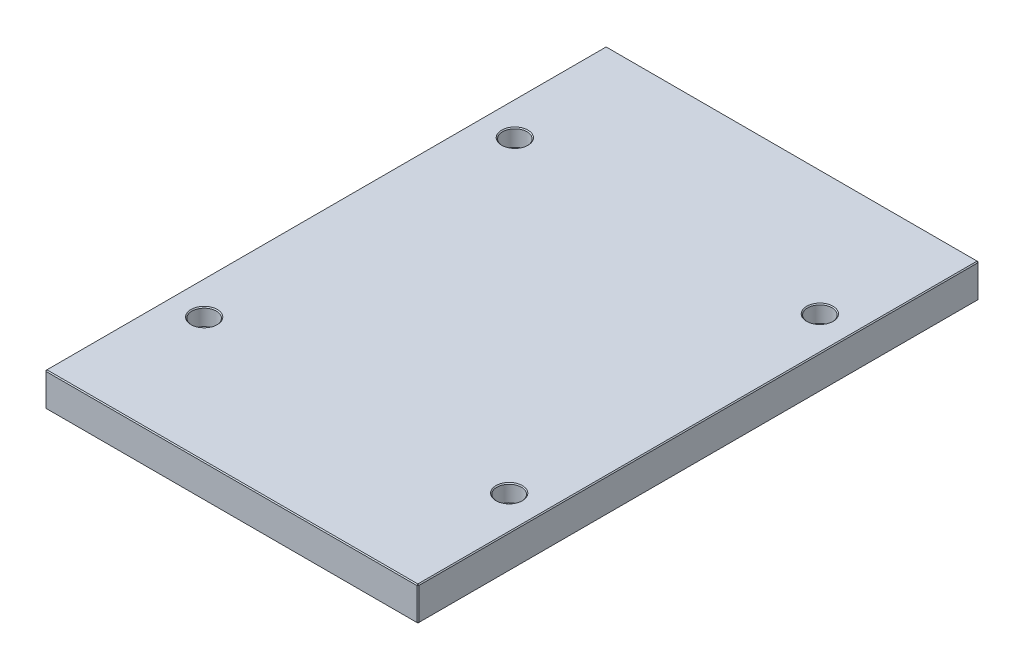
ISO-10303-21;
HEADER;
FILE_DESCRIPTION(('STEP AP214'),'2;1');
FILE_NAME('part.step','',(''),(''),'','','');
FILE_SCHEMA(('AUTOMOTIVE_DESIGN { 1 0 10303 214 1 1 1 1 }'));
ENDSEC;
DATA;
#1=APPLICATION_CONTEXT('core data for automotive mechanical design processes');
#2=APPLICATION_PROTOCOL_DEFINITION('international standard','automotive_design',2000,#1);
#3=PRODUCT_CONTEXT('',#1,'mechanical');
#4=PRODUCT('Part','Part','',(#3));
#5=PRODUCT_RELATED_PRODUCT_CATEGORY('part','',(#4));
#6=PRODUCT_DEFINITION_FORMATION('','',#4);
#7=PRODUCT_DEFINITION_CONTEXT('part definition',#1,'design');
#8=PRODUCT_DEFINITION('design','',#6,#7);
#9=PRODUCT_DEFINITION_SHAPE('','',#8);
#10=(LENGTH_UNIT() NAMED_UNIT(*) SI_UNIT(.MILLI.,.METRE.));
#11=(NAMED_UNIT(*) PLANE_ANGLE_UNIT() SI_UNIT($,.RADIAN.));
#12=(NAMED_UNIT(*) SI_UNIT($,.STERADIAN.) SOLID_ANGLE_UNIT());
#13=UNCERTAINTY_MEASURE_WITH_UNIT(LENGTH_MEASURE(1.E-05),#10,'distance_accuracy_value','');
#14=(GEOMETRIC_REPRESENTATION_CONTEXT(3) GLOBAL_UNCERTAINTY_ASSIGNED_CONTEXT((#13)) GLOBAL_UNIT_ASSIGNED_CONTEXT((#10,
#11,#12)) REPRESENTATION_CONTEXT('',''));
#15=CARTESIAN_POINT('',(0.,0.,0.));
#16=DIRECTION('',(0.,0.,1.));
#17=DIRECTION('',(1.,0.,0.));
#18=AXIS2_PLACEMENT_3D('',#15,#16,#17);
#19=CARTESIAN_POINT('',(-198.,36.,298.));
#20=DIRECTION('',(1.,0.,0.));
#21=DIRECTION('',(0.,0.,-1.));
#22=AXIS2_PLACEMENT_3D('',#19,#20,#21);
#23=PLANE('',#22);
#24=DIRECTION('',(0.,-1.,0.));
#25=VECTOR('',#24,1.);
#26=CARTESIAN_POINT('',(-198.,36.,-297.));
#27=LINE('',#26,#25);
#28=CARTESIAN_POINT('',(-198.,35.,-297.));
#29=VERTEX_POINT('',#28);
#30=CARTESIAN_POINT('',(-198.,1.,-297.));
#31=VERTEX_POINT('',#30);
#32=EDGE_CURVE('E115',#29,#31,#27,.T.);
#33=ORIENTED_EDGE('',*,*,#32,.T.);
#34=DIRECTION('',(0.,0.,1.));
#35=VECTOR('',#34,1.);
#36=CARTESIAN_POINT('',(-198.,1.,298.));
#37=LINE('',#36,#35);
#38=CARTESIAN_POINT('',(-198.,1.,297.));
#39=VERTEX_POINT('',#38);
#40=EDGE_CURVE('E111',#31,#39,#37,.T.);
#41=ORIENTED_EDGE('',*,*,#40,.T.);
#42=DIRECTION('',(0.,1.,0.));
#43=VECTOR('',#42,1.);
#44=CARTESIAN_POINT('',(-198.,36.,297.));
#45=LINE('',#44,#43);
#46=CARTESIAN_POINT('',(-198.,35.,297.));
#47=VERTEX_POINT('',#46);
#48=EDGE_CURVE('E104',#39,#47,#45,.T.);
#49=ORIENTED_EDGE('',*,*,#48,.T.);
#50=DIRECTION('',(0.,0.,-1.));
#51=VECTOR('',#50,1.);
#52=CARTESIAN_POINT('',(-198.,35.,-298.));
#53=LINE('',#52,#51);
#54=EDGE_CURVE('E108',#47,#29,#53,.T.);
#55=ORIENTED_EDGE('',*,*,#54,.T.);
#56=EDGE_LOOP('',(#33,#41,#49,#55));
#57=FACE_BOUND('',#56,.T.);
#58=ADVANCED_FACE('F16',(#57),#23,.F.);
#59=CARTESIAN_POINT('',(198.,36.,298.));
#60=DIRECTION('',(0.,0.,-1.));
#61=DIRECTION('',(-1.,0.,0.));
#62=AXIS2_PLACEMENT_3D('',#59,#60,#61);
#63=PLANE('',#62);
#64=DIRECTION('',(-1.,0.,0.));
#65=VECTOR('',#64,1.);
#66=CARTESIAN_POINT('',(-198.,35.,298.));
#67=LINE('',#66,#65);
#68=CARTESIAN_POINT('',(197.,35.,298.));
#69=VERTEX_POINT('',#68);
#70=CARTESIAN_POINT('',(-197.,35.,298.));
#71=VERTEX_POINT('',#70);
#72=EDGE_CURVE('E170',#69,#71,#67,.T.);
#73=ORIENTED_EDGE('',*,*,#72,.T.);
#74=DIRECTION('',(0.,-1.,0.));
#75=VECTOR('',#74,1.);
#76=CARTESIAN_POINT('',(-197.,36.,298.));
#77=LINE('',#76,#75);
#78=CARTESIAN_POINT('',(-197.,1.,298.));
#79=VERTEX_POINT('',#78);
#80=EDGE_CURVE('E123',#71,#79,#77,.T.);
#81=ORIENTED_EDGE('',*,*,#80,.T.);
#82=DIRECTION('',(1.,0.,0.));
#83=VECTOR('',#82,1.);
#84=CARTESIAN_POINT('',(198.,1.,298.));
#85=LINE('',#84,#83);
#86=CARTESIAN_POINT('',(197.,1.,298.));
#87=VERTEX_POINT('',#86);
#88=EDGE_CURVE('E174',#79,#87,#85,.T.);
#89=ORIENTED_EDGE('',*,*,#88,.T.);
#90=DIRECTION('',(0.,1.,0.));
#91=VECTOR('',#90,1.);
#92=CARTESIAN_POINT('',(197.,36.,298.));
#93=LINE('',#92,#91);
#94=EDGE_CURVE('E172',#87,#69,#93,.T.);
#95=ORIENTED_EDGE('',*,*,#94,.T.);
#96=EDGE_LOOP('',(#73,#81,#89,#95));
#97=FACE_BOUND('',#96,.T.);
#98=ADVANCED_FACE('F317',(#97),#63,.F.);
#99=CARTESIAN_POINT('',(198.,36.,298.));
#100=DIRECTION('',(-1.,0.,0.));
#101=DIRECTION('',(0.,0.,1.));
#102=AXIS2_PLACEMENT_3D('',#99,#100,#101);
#103=PLANE('',#102);
#104=DIRECTION('',(0.,0.,-1.));
#105=VECTOR('',#104,1.);
#106=CARTESIAN_POINT('',(198.,1.,298.));
#107=LINE('',#106,#105);
#108=CARTESIAN_POINT('',(198.,1.,297.));
#109=VERTEX_POINT('',#108);
#110=CARTESIAN_POINT('',(198.,1.,-297.));
#111=VERTEX_POINT('',#110);
#112=EDGE_CURVE('E165',#109,#111,#107,.T.);
#113=ORIENTED_EDGE('',*,*,#112,.T.);
#114=DIRECTION('',(0.,1.,0.));
#115=VECTOR('',#114,1.);
#116=CARTESIAN_POINT('',(198.,36.,-297.));
#117=LINE('',#116,#115);
#118=CARTESIAN_POINT('',(198.,35.,-297.));
#119=VERTEX_POINT('',#118);
#120=EDGE_CURVE('E167',#111,#119,#117,.T.);
#121=ORIENTED_EDGE('',*,*,#120,.T.);
#122=DIRECTION('',(0.,0.,1.));
#123=VECTOR('',#122,1.);
#124=CARTESIAN_POINT('',(198.,35.,298.));
#125=LINE('',#124,#123);
#126=CARTESIAN_POINT('',(198.,35.,297.));
#127=VERTEX_POINT('',#126);
#128=EDGE_CURVE('E161',#119,#127,#125,.T.);
#129=ORIENTED_EDGE('',*,*,#128,.T.);
#130=DIRECTION('',(0.,-1.,0.));
#131=VECTOR('',#130,1.);
#132=CARTESIAN_POINT('',(198.,36.,297.));
#133=LINE('',#132,#131);
#134=EDGE_CURVE('E163',#127,#109,#133,.T.);
#135=ORIENTED_EDGE('',*,*,#134,.T.);
#136=EDGE_LOOP('',(#113,#121,#129,#135));
#137=FACE_BOUND('',#136,.T.);
#138=ADVANCED_FACE('F323',(#137),#103,.F.);
#139=CARTESIAN_POINT('',(198.,36.,-298.));
#140=DIRECTION('',(0.,0.,1.));
#141=DIRECTION('',(1.,0.,0.));
#142=AXIS2_PLACEMENT_3D('',#139,#140,#141);
#143=PLANE('',#142);
#144=DIRECTION('',(0.,-1.,0.));
#145=VECTOR('',#144,1.);
#146=CARTESIAN_POINT('',(197.,36.,-298.));
#147=LINE('',#146,#145);
#148=CARTESIAN_POINT('',(197.,35.,-298.));
#149=VERTEX_POINT('',#148);
#150=CARTESIAN_POINT('',(197.,1.,-298.));
#151=VERTEX_POINT('',#150);
#152=EDGE_CURVE('E154',#149,#151,#147,.T.);
#153=ORIENTED_EDGE('',*,*,#152,.T.);
#154=DIRECTION('',(-1.,0.,0.));
#155=VECTOR('',#154,1.);
#156=CARTESIAN_POINT('',(198.,1.,-298.));
#157=LINE('',#156,#155);
#158=CARTESIAN_POINT('',(-197.,1.,-298.));
#159=VERTEX_POINT('',#158);
#160=EDGE_CURVE('E159',#151,#159,#157,.T.);
#161=ORIENTED_EDGE('',*,*,#160,.T.);
#162=DIRECTION('',(0.,1.,0.));
#163=VECTOR('',#162,1.);
#164=CARTESIAN_POINT('',(-197.,36.,-298.));
#165=LINE('',#164,#163);
#166=CARTESIAN_POINT('',(-197.,35.,-298.));
#167=VERTEX_POINT('',#166);
#168=EDGE_CURVE('E156',#159,#167,#165,.T.);
#169=ORIENTED_EDGE('',*,*,#168,.T.);
#170=DIRECTION('',(1.,0.,0.));
#171=VECTOR('',#170,1.);
#172=CARTESIAN_POINT('',(198.,35.,-298.));
#173=LINE('',#172,#171);
#174=EDGE_CURVE('E152',#167,#149,#173,.T.);
#175=ORIENTED_EDGE('',*,*,#174,.T.);
#176=EDGE_LOOP('',(#153,#161,#169,#175));
#177=FACE_BOUND('',#176,.T.);
#178=ADVANCED_FACE('F465',(#177),#143,.F.);
#179=CARTESIAN_POINT('',(0.,36.,0.));
#180=DIRECTION('',(0.,1.,0.));
#181=DIRECTION('',(0.,0.,1.));
#182=AXIS2_PLACEMENT_3D('',#179,#180,#181);
#183=PLANE('',#182);
#184=CARTESIAN_POINT('',(-162.,36.,165.));
#185=DIRECTION('',(0.,1.,0.));
#186=DIRECTION('',(0.,0.,1.));
#187=AXIS2_PLACEMENT_3D('',#184,#185,#186);
#188=CIRCLE('',#187,14.0000000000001);
#189=CARTESIAN_POINT('',(-162.,36.,179.));
#190=VERTEX_POINT('',#189);
#191=EDGE_CURVE('E290',#190,#190,#188,.F.);
#192=ORIENTED_EDGE('',*,*,#191,.T.);
#193=EDGE_LOOP('',(#192));
#194=FACE_BOUND('',#193,.T.);
#195=CARTESIAN_POINT('',(162.,36.,165.));
#196=DIRECTION('',(0.,1.,0.));
#197=DIRECTION('',(0.,0.,1.));
#198=AXIS2_PLACEMENT_3D('',#195,#196,#197);
#199=CIRCLE('',#198,14.0000000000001);
#200=CARTESIAN_POINT('',(162.,36.,179.));
#201=VERTEX_POINT('',#200);
#202=EDGE_CURVE('E287',#201,#201,#199,.F.);
#203=ORIENTED_EDGE('',*,*,#202,.T.);
#204=EDGE_LOOP('',(#203));
#205=FACE_BOUND('',#204,.T.);
#206=CARTESIAN_POINT('',(162.,36.,-165.));
#207=DIRECTION('',(0.,1.,0.));
#208=DIRECTION('',(0.,0.,1.));
#209=AXIS2_PLACEMENT_3D('',#206,#207,#208);
#210=CIRCLE('',#209,14.);
#211=CARTESIAN_POINT('',(162.,36.,-151.));
#212=VERTEX_POINT('',#211);
#213=EDGE_CURVE('E284',#212,#212,#210,.F.);
#214=ORIENTED_EDGE('',*,*,#213,.T.);
#215=EDGE_LOOP('',(#214));
#216=FACE_BOUND('',#215,.T.);
#217=CARTESIAN_POINT('',(-162.,36.,-165.));
#218=DIRECTION('',(0.,1.,0.));
#219=DIRECTION('',(0.,0.,1.));
#220=AXIS2_PLACEMENT_3D('',#217,#218,#219);
#221=CIRCLE('',#220,14.0000000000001);
#222=CARTESIAN_POINT('',(-162.,36.,-151.));
#223=VERTEX_POINT('',#222);
#224=EDGE_CURVE('E281',#223,#223,#221,.F.);
#225=ORIENTED_EDGE('',*,*,#224,.T.);
#226=EDGE_LOOP('',(#225));
#227=FACE_BOUND('',#226,.T.);
#228=DIRECTION('',(0.,0.,-1.));
#229=VECTOR('',#228,1.);
#230=CARTESIAN_POINT('',(197.,36.,-298.));
#231=LINE('',#230,#229);
#232=CARTESIAN_POINT('',(197.,36.,297.));
#233=VERTEX_POINT('',#232);
#234=CARTESIAN_POINT('',(197.,36.,-297.));
#235=VERTEX_POINT('',#234);
#236=EDGE_CURVE('E31',#233,#235,#231,.T.);
#237=ORIENTED_EDGE('',*,*,#236,.T.);
#238=DIRECTION('',(-1.,0.,0.));
#239=VECTOR('',#238,1.);
#240=CARTESIAN_POINT('',(-198.,36.,-297.));
#241=LINE('',#240,#239);
#242=CARTESIAN_POINT('',(-197.,36.,-297.));
#243=VERTEX_POINT('',#242);
#244=EDGE_CURVE('E190',#235,#243,#241,.T.);
#245=ORIENTED_EDGE('',*,*,#244,.T.);
#246=DIRECTION('',(0.,0.,1.));
#247=VECTOR('',#246,1.);
#248=CARTESIAN_POINT('',(-197.,36.,298.));
#249=LINE('',#248,#247);
#250=CARTESIAN_POINT('',(-197.,36.,297.));
#251=VERTEX_POINT('',#250);
#252=EDGE_CURVE('E186',#243,#251,#249,.T.);
#253=ORIENTED_EDGE('',*,*,#252,.T.);
#254=DIRECTION('',(1.,0.,0.));
#255=VECTOR('',#254,1.);
#256=CARTESIAN_POINT('',(198.,36.,297.));
#257=LINE('',#256,#255);
#258=EDGE_CURVE('E36',#251,#233,#257,.T.);
#259=ORIENTED_EDGE('',*,*,#258,.T.);
#260=EDGE_LOOP('',(#237,#245,#253,#259));
#261=FACE_BOUND('',#260,.T.);
#262=ADVANCED_FACE('F462',(#194,#205,#216,#227,#261),#183,.T.);
#263=CARTESIAN_POINT('',(0.,0.,0.));
#264=DIRECTION('',(0.,1.,0.));
#265=DIRECTION('',(0.,0.,1.));
#266=AXIS2_PLACEMENT_3D('',#263,#264,#265);
#267=PLANE('',#266);
#268=CARTESIAN_POINT('',(162.,0.,-165.));
#269=DIRECTION('',(0.,1.,0.));
#270=DIRECTION('',(0.,0.,1.));
#271=AXIS2_PLACEMENT_3D('',#268,#269,#270);
#272=CIRCLE('',#271,10.);
#273=CARTESIAN_POINT('',(162.,0.,-155.));
#274=VERTEX_POINT('',#273);
#275=EDGE_CURVE('E263',#274,#274,#272,.T.);
#276=ORIENTED_EDGE('',*,*,#275,.T.);
#277=EDGE_LOOP('',(#276));
#278=FACE_BOUND('',#277,.T.);
#279=CARTESIAN_POINT('',(162.,0.,165.));
#280=DIRECTION('',(0.,1.,0.));
#281=DIRECTION('',(0.,0.,1.));
#282=AXIS2_PLACEMENT_3D('',#279,#280,#281);
#283=CIRCLE('',#282,10.);
#284=CARTESIAN_POINT('',(162.,0.,175.));
#285=VERTEX_POINT('',#284);
#286=EDGE_CURVE('E260',#285,#285,#283,.T.);
#287=ORIENTED_EDGE('',*,*,#286,.T.);
#288=EDGE_LOOP('',(#287));
#289=FACE_BOUND('',#288,.T.);
#290=CARTESIAN_POINT('',(-162.,0.,165.));
#291=DIRECTION('',(0.,1.,0.));
#292=DIRECTION('',(0.,0.,1.));
#293=AXIS2_PLACEMENT_3D('',#290,#291,#292);
#294=CIRCLE('',#293,10.);
#295=CARTESIAN_POINT('',(-162.,0.,175.));
#296=VERTEX_POINT('',#295);
#297=EDGE_CURVE('E257',#296,#296,#294,.T.);
#298=ORIENTED_EDGE('',*,*,#297,.T.);
#299=EDGE_LOOP('',(#298));
#300=FACE_BOUND('',#299,.T.);
#301=CARTESIAN_POINT('',(-162.,0.,-165.));
#302=DIRECTION('',(0.,1.,0.));
#303=DIRECTION('',(0.,0.,1.));
#304=AXIS2_PLACEMENT_3D('',#301,#302,#303);
#305=CIRCLE('',#304,10.);
#306=CARTESIAN_POINT('',(-162.,0.,-155.));
#307=VERTEX_POINT('',#306);
#308=EDGE_CURVE('E192',#307,#307,#305,.T.);
#309=ORIENTED_EDGE('',*,*,#308,.T.);
#310=EDGE_LOOP('',(#309));
#311=FACE_BOUND('',#310,.T.);
#312=DIRECTION('',(0.,0.,1.));
#313=VECTOR('',#312,1.);
#314=CARTESIAN_POINT('',(197.,0.,0.));
#315=LINE('',#314,#313);
#316=CARTESIAN_POINT('',(197.,0.,-297.));
#317=VERTEX_POINT('',#316);
#318=CARTESIAN_POINT('',(197.,0.,297.));
#319=VERTEX_POINT('',#318);
#320=EDGE_CURVE('E177',#317,#319,#315,.T.);
#321=ORIENTED_EDGE('',*,*,#320,.T.);
#322=DIRECTION('',(-1.,0.,0.));
#323=VECTOR('',#322,1.);
#324=CARTESIAN_POINT('',(0.,0.,297.));
#325=LINE('',#324,#323);
#326=CARTESIAN_POINT('',(-197.,0.,297.));
#327=VERTEX_POINT('',#326);
#328=EDGE_CURVE('E183',#319,#327,#325,.T.);
#329=ORIENTED_EDGE('',*,*,#328,.T.);
#330=DIRECTION('',(0.,0.,-1.));
#331=VECTOR('',#330,1.);
#332=CARTESIAN_POINT('',(-197.,0.,0.));
#333=LINE('',#332,#331);
#334=CARTESIAN_POINT('',(-197.,0.,-297.));
#335=VERTEX_POINT('',#334);
#336=EDGE_CURVE('E181',#327,#335,#333,.T.);
#337=ORIENTED_EDGE('',*,*,#336,.T.);
#338=DIRECTION('',(1.,0.,0.));
#339=VECTOR('',#338,1.);
#340=CARTESIAN_POINT('',(0.,0.,-297.));
#341=LINE('',#340,#339);
#342=EDGE_CURVE('E179',#335,#317,#341,.T.);
#343=ORIENTED_EDGE('',*,*,#342,.T.);
#344=EDGE_LOOP('',(#321,#329,#337,#343));
#345=FACE_BOUND('',#344,.T.);
#346=ADVANCED_FACE('F402',(#278,#289,#300,#311,#345),#267,.F.);
#347=CARTESIAN_POINT('',(198.,36.,297.));
#348=DIRECTION('',(-0.707106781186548,0.,-0.707106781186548));
#349=DIRECTION('',(0.,-1.,0.));
#350=AXIS2_PLACEMENT_3D('',#347,#348,#349);
#351=PLANE('',#350);
#352=DIRECTION('',(-0.707106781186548,0.,0.707106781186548));
#353=VECTOR('',#352,1.);
#354=CARTESIAN_POINT('',(197.,35.,298.));
#355=LINE('',#354,#353);
#356=EDGE_CURVE('E141',#69,#127,#355,.F.);
#357=ORIENTED_EDGE('',*,*,#356,.F.);
#358=ORIENTED_EDGE('',*,*,#94,.F.);
#359=DIRECTION('',(0.707106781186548,0.,-0.707106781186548));
#360=VECTOR('',#359,1.);
#361=CARTESIAN_POINT('',(197.,1.,298.));
#362=LINE('',#361,#360);
#363=EDGE_CURVE('E144',#109,#87,#362,.F.);
#364=ORIENTED_EDGE('',*,*,#363,.F.);
#365=ORIENTED_EDGE('',*,*,#134,.F.);
#366=EDGE_LOOP('',(#357,#358,#364,#365));
#367=FACE_BOUND('',#366,.T.);
#368=ADVANCED_FACE('F398',(#367),#351,.F.);
#369=CARTESIAN_POINT('',(197.,35.,298.));
#370=DIRECTION('',(0.577350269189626,0.577350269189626,0.577350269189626));
#371=DIRECTION('',(0.707106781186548,0.,-0.707106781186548));
#372=AXIS2_PLACEMENT_3D('',#369,#370,#371);
#373=PLANE('',#372);
#374=DIRECTION('',(0.,-0.707106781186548,0.707106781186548));
#375=VECTOR('',#374,1.);
#376=CARTESIAN_POINT('',(197.,35.,298.));
#377=LINE('',#376,#375);
#378=EDGE_CURVE('E235',#69,#233,#377,.F.);
#379=ORIENTED_EDGE('',*,*,#378,.F.);
#380=ORIENTED_EDGE('',*,*,#356,.T.);
#381=DIRECTION('',(-0.707106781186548,0.707106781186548,0.));
#382=VECTOR('',#381,1.);
#383=CARTESIAN_POINT('',(197.5,35.5,297.));
#384=LINE('',#383,#382);
#385=EDGE_CURVE('E237',#233,#127,#384,.F.);
#386=ORIENTED_EDGE('',*,*,#385,.F.);
#387=EDGE_LOOP('',(#379,#380,#386));
#388=FACE_BOUND('',#387,.T.);
#389=ADVANCED_FACE('F394',(#388),#373,.T.);
#390=CARTESIAN_POINT('',(197.,1.,298.));
#391=DIRECTION('',(0.577350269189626,-0.577350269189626,0.577350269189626));
#392=DIRECTION('',(0.707106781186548,0.,-0.707106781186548));
#393=AXIS2_PLACEMENT_3D('',#390,#391,#392);
#394=PLANE('',#393);
#395=DIRECTION('',(-0.707106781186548,-0.707106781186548,0.));
#396=VECTOR('',#395,1.);
#397=CARTESIAN_POINT('',(197.5,0.5,297.));
#398=LINE('',#397,#396);
#399=EDGE_CURVE('E229',#109,#319,#398,.T.);
#400=ORIENTED_EDGE('',*,*,#399,.F.);
#401=ORIENTED_EDGE('',*,*,#363,.T.);
#402=DIRECTION('',(0.,0.707106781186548,0.707106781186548));
#403=VECTOR('',#402,1.);
#404=CARTESIAN_POINT('',(197.,1.,298.));
#405=LINE('',#404,#403);
#406=EDGE_CURVE('E232',#319,#87,#405,.T.);
#407=ORIENTED_EDGE('',*,*,#406,.F.);
#408=EDGE_LOOP('',(#400,#401,#407));
#409=FACE_BOUND('',#408,.T.);
#410=ADVANCED_FACE('F390',(#409),#394,.T.);
#411=CARTESIAN_POINT('',(197.,36.,0.));
#412=DIRECTION('',(0.707106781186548,0.707106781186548,0.));
#413=DIRECTION('',(0.,0.,1.));
#414=AXIS2_PLACEMENT_3D('',#411,#412,#413);
#415=PLANE('',#414);
#416=ORIENTED_EDGE('',*,*,#385,.T.);
#417=ORIENTED_EDGE('',*,*,#128,.F.);
#418=DIRECTION('',(0.707106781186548,-0.707106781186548,0.));
#419=VECTOR('',#418,1.);
#420=CARTESIAN_POINT('',(198.,35.,-297.));
#421=LINE('',#420,#419);
#422=EDGE_CURVE('E224',#235,#119,#421,.T.);
#423=ORIENTED_EDGE('',*,*,#422,.F.);
#424=ORIENTED_EDGE('',*,*,#236,.F.);
#425=EDGE_LOOP('',(#416,#417,#423,#424));
#426=FACE_BOUND('',#425,.T.);
#427=ADVANCED_FACE('F386',(#426),#415,.T.);
#428=CARTESIAN_POINT('',(0.,36.,297.));
#429=DIRECTION('',(0.,0.707106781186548,0.707106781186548));
#430=DIRECTION('',(-1.,0.,0.));
#431=AXIS2_PLACEMENT_3D('',#428,#429,#430);
#432=PLANE('',#431);
#433=ORIENTED_EDGE('',*,*,#378,.T.);
#434=ORIENTED_EDGE('',*,*,#258,.F.);
#435=DIRECTION('',(0.,0.707106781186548,-0.707106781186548));
#436=VECTOR('',#435,1.);
#437=CARTESIAN_POINT('',(-197.,35.5,297.5));
#438=LINE('',#437,#436);
#439=EDGE_CURVE('E127',#71,#251,#438,.T.);
#440=ORIENTED_EDGE('',*,*,#439,.F.);
#441=ORIENTED_EDGE('',*,*,#72,.F.);
#442=EDGE_LOOP('',(#433,#434,#440,#441));
#443=FACE_BOUND('',#442,.T.);
#444=ADVANCED_FACE('F383',(#443),#432,.T.);
#445=CARTESIAN_POINT('',(-197.,36.,298.));
#446=DIRECTION('',(0.707106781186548,0.,-0.707106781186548));
#447=DIRECTION('',(0.,-1.,0.));
#448=AXIS2_PLACEMENT_3D('',#445,#446,#447);
#449=PLANE('',#448);
#450=DIRECTION('',(0.707106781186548,0.,0.707106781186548));
#451=VECTOR('',#450,1.);
#452=CARTESIAN_POINT('',(-197.,1.,298.));
#453=LINE('',#452,#451);
#454=EDGE_CURVE('E128',#79,#39,#453,.F.);
#455=ORIENTED_EDGE('',*,*,#454,.F.);
#456=ORIENTED_EDGE('',*,*,#80,.F.);
#457=DIRECTION('',(-0.707106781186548,0.,-0.707106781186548));
#458=VECTOR('',#457,1.);
#459=CARTESIAN_POINT('',(-198.,35.,297.));
#460=LINE('',#459,#458);
#461=EDGE_CURVE('E119',#47,#71,#460,.F.);
#462=ORIENTED_EDGE('',*,*,#461,.F.);
#463=ORIENTED_EDGE('',*,*,#48,.F.);
#464=EDGE_LOOP('',(#455,#456,#462,#463));
#465=FACE_BOUND('',#464,.T.);
#466=ADVANCED_FACE('F121',(#465),#449,.F.);
#467=CARTESIAN_POINT('',(198.,1.,298.));
#468=DIRECTION('',(0.,0.707106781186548,-0.707106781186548));
#469=DIRECTION('',(1.,0.,0.));
#470=AXIS2_PLACEMENT_3D('',#467,#468,#469);
#471=PLANE('',#470);
#472=ORIENTED_EDGE('',*,*,#406,.T.);
#473=ORIENTED_EDGE('',*,*,#88,.F.);
#474=DIRECTION('',(0.,-0.707106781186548,-0.707106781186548));
#475=VECTOR('',#474,1.);
#476=CARTESIAN_POINT('',(-197.,1.,298.));
#477=LINE('',#476,#475);
#478=EDGE_CURVE('E220',#327,#79,#477,.F.);
#479=ORIENTED_EDGE('',*,*,#478,.F.);
#480=ORIENTED_EDGE('',*,*,#328,.F.);
#481=EDGE_LOOP('',(#472,#473,#479,#480));
#482=FACE_BOUND('',#481,.T.);
#483=ADVANCED_FACE('F376',(#482),#471,.F.);
#484=CARTESIAN_POINT('',(198.,1.,298.));
#485=DIRECTION('',(-0.707106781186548,0.707106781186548,0.));
#486=DIRECTION('',(0.,0.,-1.));
#487=AXIS2_PLACEMENT_3D('',#484,#485,#486);
#488=PLANE('',#487);
#489=ORIENTED_EDGE('',*,*,#399,.T.);
#490=ORIENTED_EDGE('',*,*,#320,.F.);
#491=DIRECTION('',(0.707106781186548,0.707106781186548,0.));
#492=VECTOR('',#491,1.);
#493=CARTESIAN_POINT('',(197.5,0.500000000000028,-297.));
#494=LINE('',#493,#492);
#495=EDGE_CURVE('E217',#111,#317,#494,.F.);
#496=ORIENTED_EDGE('',*,*,#495,.F.);
#497=ORIENTED_EDGE('',*,*,#112,.F.);
#498=EDGE_LOOP('',(#489,#490,#496,#497));
#499=FACE_BOUND('',#498,.T.);
#500=ADVANCED_FACE('F372',(#499),#488,.F.);
#501=CARTESIAN_POINT('',(197.,36.,-298.));
#502=DIRECTION('',(-0.707106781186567,0.,0.707106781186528));
#503=DIRECTION('',(0.,-1.,0.));
#504=AXIS2_PLACEMENT_3D('',#501,#502,#503);
#505=PLANE('',#504);
#506=DIRECTION('',(0.707106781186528,0.,0.707106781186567));
#507=VECTOR('',#506,1.);
#508=CARTESIAN_POINT('',(198.,35.,-297.));
#509=LINE('',#508,#507);
#510=EDGE_CURVE('E226',#119,#149,#509,.F.);
#511=ORIENTED_EDGE('',*,*,#510,.F.);
#512=ORIENTED_EDGE('',*,*,#120,.F.);
#513=DIRECTION('',(-0.707106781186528,0.,-0.707106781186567));
#514=VECTOR('',#513,1.);
#515=CARTESIAN_POINT('',(197.,1.,-298.));
#516=LINE('',#515,#514);
#517=EDGE_CURVE('E214',#151,#111,#516,.F.);
#518=ORIENTED_EDGE('',*,*,#517,.F.);
#519=ORIENTED_EDGE('',*,*,#152,.F.);
#520=EDGE_LOOP('',(#511,#512,#518,#519));
#521=FACE_BOUND('',#520,.T.);
#522=ADVANCED_FACE('F368',(#521),#505,.F.);
#523=CARTESIAN_POINT('',(198.,35.,-297.));
#524=DIRECTION('',(0.577350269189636,0.577350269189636,-0.577350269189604));
#525=DIRECTION('',(-0.707106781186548,0.707106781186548,0.));
#526=AXIS2_PLACEMENT_3D('',#523,#524,#525);
#527=PLANE('',#526);
#528=ORIENTED_EDGE('',*,*,#422,.T.);
#529=ORIENTED_EDGE('',*,*,#510,.T.);
#530=DIRECTION('',(0.,0.707106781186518,0.707106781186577));
#531=VECTOR('',#530,1.);
#532=CARTESIAN_POINT('',(197.,35.5,-297.5));
#533=LINE('',#532,#531);
#534=EDGE_CURVE('E135',#235,#149,#533,.F.);
#535=ORIENTED_EDGE('',*,*,#534,.F.);
#536=EDGE_LOOP('',(#528,#529,#535));
#537=FACE_BOUND('',#536,.T.);
#538=ADVANCED_FACE('F365',(#537),#527,.T.);
#539=CARTESIAN_POINT('',(-198.,35.,297.));
#540=DIRECTION('',(-0.577350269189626,0.577350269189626,0.577350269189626));
#541=DIRECTION('',(0.707106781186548,0.,0.707106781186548));
#542=AXIS2_PLACEMENT_3D('',#539,#540,#541);
#543=PLANE('',#542);
#544=ORIENTED_EDGE('',*,*,#461,.T.);
#545=ORIENTED_EDGE('',*,*,#439,.T.);
#546=DIRECTION('',(-0.707106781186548,-0.707106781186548,0.));
#547=VECTOR('',#546,1.);
#548=CARTESIAN_POINT('',(-198.,35.,297.));
#549=LINE('',#548,#547);
#550=EDGE_CURVE('E131',#47,#251,#549,.F.);
#551=ORIENTED_EDGE('',*,*,#550,.F.);
#552=EDGE_LOOP('',(#544,#545,#551));
#553=FACE_BOUND('',#552,.T.);
#554=ADVANCED_FACE('F132',(#553),#543,.T.);
#555=CARTESIAN_POINT('',(-197.,1.,298.));
#556=DIRECTION('',(-0.577350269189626,-0.577350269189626,0.577350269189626));
#557=DIRECTION('',(0.707106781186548,0.,0.707106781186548));
#558=AXIS2_PLACEMENT_3D('',#555,#556,#557);
#559=PLANE('',#558);
#560=ORIENTED_EDGE('',*,*,#478,.T.);
#561=ORIENTED_EDGE('',*,*,#454,.T.);
#562=DIRECTION('',(-0.707106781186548,0.707106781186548,0.));
#563=VECTOR('',#562,1.);
#564=CARTESIAN_POINT('',(-197.5,0.5,297.));
#565=LINE('',#564,#563);
#566=EDGE_CURVE('E136',#327,#39,#565,.T.);
#567=ORIENTED_EDGE('',*,*,#566,.F.);
#568=EDGE_LOOP('',(#560,#561,#567));
#569=FACE_BOUND('',#568,.T.);
#570=ADVANCED_FACE('F358',(#569),#559,.T.);
#571=CARTESIAN_POINT('',(197.,1.,-298.));
#572=DIRECTION('',(0.577350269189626,-0.577350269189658,-0.577350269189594));
#573=DIRECTION('',(0.707106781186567,0.707106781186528,0.));
#574=AXIS2_PLACEMENT_3D('',#571,#572,#573);
#575=PLANE('',#574);
#576=ORIENTED_EDGE('',*,*,#517,.T.);
#577=ORIENTED_EDGE('',*,*,#495,.T.);
#578=DIRECTION('',(0.,-0.707106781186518,0.707106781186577));
#579=VECTOR('',#578,1.);
#580=CARTESIAN_POINT('',(197.,1.,-298.));
#581=LINE('',#580,#579);
#582=EDGE_CURVE('E207',#151,#317,#581,.T.);
#583=ORIENTED_EDGE('',*,*,#582,.F.);
#584=EDGE_LOOP('',(#576,#577,#583));
#585=FACE_BOUND('',#584,.T.);
#586=ADVANCED_FACE('F354',(#585),#575,.T.);
#587=CARTESIAN_POINT('',(0.,36.,-297.));
#588=DIRECTION('',(0.,0.707106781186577,-0.707106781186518));
#589=DIRECTION('',(1.,0.,0.));
#590=AXIS2_PLACEMENT_3D('',#587,#588,#589);
#591=PLANE('',#590);
#592=ORIENTED_EDGE('',*,*,#534,.T.);
#593=ORIENTED_EDGE('',*,*,#174,.F.);
#594=DIRECTION('',(0.,-0.707106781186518,-0.707106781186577));
#595=VECTOR('',#594,1.);
#596=CARTESIAN_POINT('',(-197.,35.,-298.));
#597=LINE('',#596,#595);
#598=EDGE_CURVE('E204',#243,#167,#597,.T.);
#599=ORIENTED_EDGE('',*,*,#598,.F.);
#600=ORIENTED_EDGE('',*,*,#244,.F.);
#601=EDGE_LOOP('',(#592,#593,#599,#600));
#602=FACE_BOUND('',#601,.T.);
#603=ADVANCED_FACE('F351',(#602),#591,.T.);
#604=CARTESIAN_POINT('',(-197.,36.,0.));
#605=DIRECTION('',(-0.707106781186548,0.707106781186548,0.));
#606=DIRECTION('',(0.,0.,-1.));
#607=AXIS2_PLACEMENT_3D('',#604,#605,#606);
#608=PLANE('',#607);
#609=ORIENTED_EDGE('',*,*,#550,.T.);
#610=ORIENTED_EDGE('',*,*,#252,.F.);
#611=DIRECTION('',(0.707106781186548,0.707106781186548,0.));
#612=VECTOR('',#611,1.);
#613=CARTESIAN_POINT('',(-197.5,35.5,-297.));
#614=LINE('',#613,#612);
#615=EDGE_CURVE('E139',#29,#243,#614,.T.);
#616=ORIENTED_EDGE('',*,*,#615,.F.);
#617=ORIENTED_EDGE('',*,*,#54,.F.);
#618=EDGE_LOOP('',(#609,#610,#616,#617));
#619=FACE_BOUND('',#618,.T.);
#620=ADVANCED_FACE('F138',(#619),#608,.T.);
#621=CARTESIAN_POINT('',(-198.,1.,298.));
#622=DIRECTION('',(0.707106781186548,0.707106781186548,0.));
#623=DIRECTION('',(0.,0.,1.));
#624=AXIS2_PLACEMENT_3D('',#621,#622,#623);
#625=PLANE('',#624);
#626=ORIENTED_EDGE('',*,*,#566,.T.);
#627=ORIENTED_EDGE('',*,*,#40,.F.);
#628=DIRECTION('',(0.707106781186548,-0.707106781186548,0.));
#629=VECTOR('',#628,1.);
#630=CARTESIAN_POINT('',(-198.,1.,-297.));
#631=LINE('',#630,#629);
#632=EDGE_CURVE('E200',#335,#31,#631,.F.);
#633=ORIENTED_EDGE('',*,*,#632,.F.);
#634=ORIENTED_EDGE('',*,*,#336,.F.);
#635=EDGE_LOOP('',(#626,#627,#633,#634));
#636=FACE_BOUND('',#635,.T.);
#637=ADVANCED_FACE('F344',(#636),#625,.F.);
#638=CARTESIAN_POINT('',(198.,1.,-298.));
#639=DIRECTION('',(0.,0.707106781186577,0.707106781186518));
#640=DIRECTION('',(-1.,0.,0.));
#641=AXIS2_PLACEMENT_3D('',#638,#639,#640);
#642=PLANE('',#641);
#643=ORIENTED_EDGE('',*,*,#582,.T.);
#644=ORIENTED_EDGE('',*,*,#342,.F.);
#645=DIRECTION('',(0.,0.707106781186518,-0.707106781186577));
#646=VECTOR('',#645,1.);
#647=CARTESIAN_POINT('',(-197.,0.500000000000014,-297.5));
#648=LINE('',#647,#646);
#649=EDGE_CURVE('E197',#159,#335,#648,.F.);
#650=ORIENTED_EDGE('',*,*,#649,.F.);
#651=ORIENTED_EDGE('',*,*,#160,.F.);
#652=EDGE_LOOP('',(#643,#644,#650,#651));
#653=FACE_BOUND('',#652,.T.);
#654=ADVANCED_FACE('F340',(#653),#642,.F.);
#655=CARTESIAN_POINT('',(-197.,35.,-298.));
#656=DIRECTION('',(-0.577350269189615,0.577350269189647,-0.577350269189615));
#657=DIRECTION('',(0.,0.707106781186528,0.707106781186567));
#658=AXIS2_PLACEMENT_3D('',#655,#656,#657);
#659=PLANE('',#658);
#660=ORIENTED_EDGE('',*,*,#615,.T.);
#661=ORIENTED_EDGE('',*,*,#598,.T.);
#662=DIRECTION('',(0.707106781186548,0.,-0.707106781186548));
#663=VECTOR('',#662,1.);
#664=CARTESIAN_POINT('',(-197.,35.,-298.));
#665=LINE('',#664,#663);
#666=EDGE_CURVE('E195',#29,#167,#665,.T.);
#667=ORIENTED_EDGE('',*,*,#666,.F.);
#668=EDGE_LOOP('',(#660,#661,#667));
#669=FACE_BOUND('',#668,.T.);
#670=ADVANCED_FACE('F336',(#669),#659,.T.);
#671=CARTESIAN_POINT('',(-198.,1.,-297.));
#672=DIRECTION('',(-0.577350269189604,-0.577350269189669,-0.577350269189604));
#673=DIRECTION('',(0.,0.707106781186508,-0.707106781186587));
#674=AXIS2_PLACEMENT_3D('',#671,#672,#673);
#675=PLANE('',#674);
#676=ORIENTED_EDGE('',*,*,#649,.T.);
#677=ORIENTED_EDGE('',*,*,#632,.T.);
#678=DIRECTION('',(-0.707106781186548,0.,0.707106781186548));
#679=VECTOR('',#678,1.);
#680=CARTESIAN_POINT('',(-198.,1.,-297.));
#681=LINE('',#680,#679);
#682=EDGE_CURVE('E193',#159,#31,#681,.T.);
#683=ORIENTED_EDGE('',*,*,#682,.F.);
#684=EDGE_LOOP('',(#676,#677,#683));
#685=FACE_BOUND('',#684,.T.);
#686=ADVANCED_FACE('F332',(#685),#675,.T.);
#687=CARTESIAN_POINT('',(-198.,36.,-297.));
#688=DIRECTION('',(0.707106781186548,0.,0.707106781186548));
#689=DIRECTION('',(0.,-1.,0.));
#690=AXIS2_PLACEMENT_3D('',#687,#688,#689);
#691=PLANE('',#690);
#692=ORIENTED_EDGE('',*,*,#666,.T.);
#693=ORIENTED_EDGE('',*,*,#168,.F.);
#694=ORIENTED_EDGE('',*,*,#682,.T.);
#695=ORIENTED_EDGE('',*,*,#32,.F.);
#696=EDGE_LOOP('',(#692,#693,#694,#695));
#697=FACE_BOUND('',#696,.T.);
#698=ADVANCED_FACE('F328',(#697),#691,.F.);
#699=CARTESIAN_POINT('',(-162.,18.,-165.));
#700=DIRECTION('',(0.,1.,0.));
#701=DIRECTION('',(0.,0.,1.));
#702=AXIS2_PLACEMENT_3D('',#699,#700,#701);
#703=CYLINDRICAL_SURFACE('',#702,13.);
#704=CARTESIAN_POINT('',(-162.,35.,-165.));
#705=DIRECTION('',(0.,1.,0.));
#706=DIRECTION('',(0.,0.,1.));
#707=AXIS2_PLACEMENT_3D('',#704,#705,#706);
#708=CIRCLE('',#707,13.);
#709=CARTESIAN_POINT('',(-162.,35.,-152.));
#710=VERTEX_POINT('',#709);
#711=EDGE_CURVE('E10',#710,#710,#708,.T.);
#712=ORIENTED_EDGE('',*,*,#711,.T.);
#713=EDGE_LOOP('',(#712));
#714=FACE_BOUND('',#713,.T.);
#715=CARTESIAN_POINT('',(-162.,18.,-165.));
#716=DIRECTION('',(0.,1.,0.));
#717=DIRECTION('',(0.,0.,1.));
#718=AXIS2_PLACEMENT_3D('',#715,#716,#717);
#719=CIRCLE('',#718,13.);
#720=CARTESIAN_POINT('',(-162.,18.,-152.));
#721=VERTEX_POINT('',#720);
#722=EDGE_CURVE('E147',#721,#721,#719,.T.);
#723=ORIENTED_EDGE('',*,*,#722,.F.);
#724=EDGE_LOOP('',(#723));
#725=FACE_BOUND('',#724,.T.);
#726=ADVANCED_FACE('F331',(#714,#725),#703,.F.);
#727=CARTESIAN_POINT('',(-162.,18.,-165.));
#728=DIRECTION('',(0.,1.,0.));
#729=DIRECTION('',(0.,0.,1.));
#730=AXIS2_PLACEMENT_3D('',#727,#728,#729);
#731=PLANE('',#730);
#732=CARTESIAN_POINT('',(-162.,18.,-165.));
#733=DIRECTION('',(0.,1.,0.));
#734=DIRECTION('',(0.,0.,1.));
#735=AXIS2_PLACEMENT_3D('',#732,#733,#734);
#736=CIRCLE('',#735,9.);
#737=CARTESIAN_POINT('',(-162.,18.,-156.));
#738=VERTEX_POINT('',#737);
#739=EDGE_CURVE('E251',#738,#738,#736,.T.);
#740=ORIENTED_EDGE('',*,*,#739,.F.);
#741=EDGE_LOOP('',(#740));
#742=FACE_BOUND('',#741,.T.);
#743=ORIENTED_EDGE('',*,*,#722,.T.);
#744=EDGE_LOOP('',(#743));
#745=FACE_BOUND('',#744,.T.);
#746=ADVANCED_FACE('F450',(#742,#745),#731,.T.);
#747=CARTESIAN_POINT('',(162.,18.,-165.));
#748=DIRECTION('',(0.,1.,0.));
#749=DIRECTION('',(0.,0.,1.));
#750=AXIS2_PLACEMENT_3D('',#747,#748,#749);
#751=CYLINDRICAL_SURFACE('',#750,13.);
#752=CARTESIAN_POINT('',(162.,35.,-165.));
#753=DIRECTION('',(0.,1.,0.));
#754=DIRECTION('',(0.,0.,1.));
#755=AXIS2_PLACEMENT_3D('',#752,#753,#754);
#756=CIRCLE('',#755,13.);
#757=CARTESIAN_POINT('',(162.,35.,-152.));
#758=VERTEX_POINT('',#757);
#759=EDGE_CURVE('E24',#758,#758,#756,.T.);
#760=ORIENTED_EDGE('',*,*,#759,.T.);
#761=EDGE_LOOP('',(#760));
#762=FACE_BOUND('',#761,.T.);
#763=CARTESIAN_POINT('',(162.,18.,-165.));
#764=DIRECTION('',(0.,1.,0.));
#765=DIRECTION('',(0.,0.,1.));
#766=AXIS2_PLACEMENT_3D('',#763,#764,#765);
#767=CIRCLE('',#766,13.);
#768=CARTESIAN_POINT('',(162.,18.,-152.));
#769=VERTEX_POINT('',#768);
#770=EDGE_CURVE('E441',#769,#769,#767,.T.);
#771=ORIENTED_EDGE('',*,*,#770,.F.);
#772=EDGE_LOOP('',(#771));
#773=FACE_BOUND('',#772,.T.);
#774=ADVANCED_FACE('F298',(#762,#773),#751,.F.);
#775=CARTESIAN_POINT('',(162.,18.,-165.));
#776=DIRECTION('',(0.,1.,0.));
#777=DIRECTION('',(0.,0.,1.));
#778=AXIS2_PLACEMENT_3D('',#775,#776,#777);
#779=PLANE('',#778);
#780=CARTESIAN_POINT('',(162.,18.,-165.));
#781=DIRECTION('',(0.,1.,0.));
#782=DIRECTION('',(0.,0.,1.));
#783=AXIS2_PLACEMENT_3D('',#780,#781,#782);
#784=CIRCLE('',#783,9.);
#785=CARTESIAN_POINT('',(162.,18.,-156.));
#786=VERTEX_POINT('',#785);
#787=EDGE_CURVE('E248',#786,#786,#784,.T.);
#788=ORIENTED_EDGE('',*,*,#787,.F.);
#789=EDGE_LOOP('',(#788));
#790=FACE_BOUND('',#789,.T.);
#791=ORIENTED_EDGE('',*,*,#770,.T.);
#792=EDGE_LOOP('',(#791));
#793=FACE_BOUND('',#792,.T.);
#794=ADVANCED_FACE('F738',(#790,#793),#779,.T.);
#795=CARTESIAN_POINT('',(162.,18.,165.));
#796=DIRECTION('',(0.,1.,0.));
#797=DIRECTION('',(0.,0.,1.));
#798=AXIS2_PLACEMENT_3D('',#795,#796,#797);
#799=CYLINDRICAL_SURFACE('',#798,13.);
#800=CARTESIAN_POINT('',(162.,35.,165.));
#801=DIRECTION('',(0.,1.,0.));
#802=DIRECTION('',(0.,0.,1.));
#803=AXIS2_PLACEMENT_3D('',#800,#801,#802);
#804=CIRCLE('',#803,13.);
#805=CARTESIAN_POINT('',(162.,35.,178.));
#806=VERTEX_POINT('',#805);
#807=EDGE_CURVE('E293',#806,#806,#804,.T.);
#808=ORIENTED_EDGE('',*,*,#807,.T.);
#809=EDGE_LOOP('',(#808));
#810=FACE_BOUND('',#809,.T.);
#811=CARTESIAN_POINT('',(162.,18.,165.));
#812=DIRECTION('',(0.,1.,0.));
#813=DIRECTION('',(0.,0.,1.));
#814=AXIS2_PLACEMENT_3D('',#811,#812,#813);
#815=CIRCLE('',#814,13.);
#816=CARTESIAN_POINT('',(162.,18.,178.));
#817=VERTEX_POINT('',#816);
#818=EDGE_CURVE('E439',#817,#817,#815,.T.);
#819=ORIENTED_EDGE('',*,*,#818,.F.);
#820=EDGE_LOOP('',(#819));
#821=FACE_BOUND('',#820,.T.);
#822=ADVANCED_FACE('F730',(#810,#821),#799,.F.);
#823=CARTESIAN_POINT('',(162.,18.,165.));
#824=DIRECTION('',(0.,1.,0.));
#825=DIRECTION('',(0.,0.,1.));
#826=AXIS2_PLACEMENT_3D('',#823,#824,#825);
#827=PLANE('',#826);
#828=CARTESIAN_POINT('',(162.,18.,165.));
#829=DIRECTION('',(0.,1.,0.));
#830=DIRECTION('',(0.,0.,1.));
#831=AXIS2_PLACEMENT_3D('',#828,#829,#830);
#832=CIRCLE('',#831,9.);
#833=CARTESIAN_POINT('',(162.,18.,174.));
#834=VERTEX_POINT('',#833);
#835=EDGE_CURVE('E245',#834,#834,#832,.T.);
#836=ORIENTED_EDGE('',*,*,#835,.F.);
#837=EDGE_LOOP('',(#836));
#838=FACE_BOUND('',#837,.T.);
#839=ORIENTED_EDGE('',*,*,#818,.T.);
#840=EDGE_LOOP('',(#839));
#841=FACE_BOUND('',#840,.T.);
#842=ADVANCED_FACE('F434',(#838,#841),#827,.T.);
#843=CARTESIAN_POINT('',(-162.,18.,165.));
#844=DIRECTION('',(0.,1.,0.));
#845=DIRECTION('',(0.,0.,1.));
#846=AXIS2_PLACEMENT_3D('',#843,#844,#845);
#847=CYLINDRICAL_SURFACE('',#846,13.);
#848=CARTESIAN_POINT('',(-162.,35.,165.));
#849=DIRECTION('',(0.,1.,0.));
#850=DIRECTION('',(0.,0.,1.));
#851=AXIS2_PLACEMENT_3D('',#848,#849,#850);
#852=CIRCLE('',#851,13.);
#853=CARTESIAN_POINT('',(-162.,35.,178.));
#854=VERTEX_POINT('',#853);
#855=EDGE_CURVE('E278',#854,#854,#852,.T.);
#856=ORIENTED_EDGE('',*,*,#855,.T.);
#857=EDGE_LOOP('',(#856));
#858=FACE_BOUND('',#857,.T.);
#859=CARTESIAN_POINT('',(-162.,18.,165.));
#860=DIRECTION('',(0.,1.,0.));
#861=DIRECTION('',(0.,0.,1.));
#862=AXIS2_PLACEMENT_3D('',#859,#860,#861);
#863=CIRCLE('',#862,13.);
#864=CARTESIAN_POINT('',(-162.,18.,178.));
#865=VERTEX_POINT('',#864);
#866=EDGE_CURVE('E254',#865,#865,#863,.T.);
#867=ORIENTED_EDGE('',*,*,#866,.F.);
#868=EDGE_LOOP('',(#867));
#869=FACE_BOUND('',#868,.T.);
#870=ADVANCED_FACE('F430',(#858,#869),#847,.F.);
#871=CARTESIAN_POINT('',(-162.,18.,165.));
#872=DIRECTION('',(0.,1.,0.));
#873=DIRECTION('',(0.,0.,1.));
#874=AXIS2_PLACEMENT_3D('',#871,#872,#873);
#875=PLANE('',#874);
#876=CARTESIAN_POINT('',(-162.,18.,165.));
#877=DIRECTION('',(0.,1.,0.));
#878=DIRECTION('',(0.,0.,1.));
#879=AXIS2_PLACEMENT_3D('',#876,#877,#878);
#880=CIRCLE('',#879,9.);
#881=CARTESIAN_POINT('',(-162.,18.,174.));
#882=VERTEX_POINT('',#881);
#883=EDGE_CURVE('E242',#882,#882,#880,.T.);
#884=ORIENTED_EDGE('',*,*,#883,.F.);
#885=EDGE_LOOP('',(#884));
#886=FACE_BOUND('',#885,.T.);
#887=ORIENTED_EDGE('',*,*,#866,.T.);
#888=EDGE_LOOP('',(#887));
#889=FACE_BOUND('',#888,.T.);
#890=ADVANCED_FACE('F433',(#886,#889),#875,.T.);
#891=CARTESIAN_POINT('',(-162.,0.,165.));
#892=DIRECTION('',(0.,1.,0.));
#893=DIRECTION('',(0.,0.,1.));
#894=AXIS2_PLACEMENT_3D('',#891,#892,#893);
#895=CYLINDRICAL_SURFACE('',#894,9.);
#896=CARTESIAN_POINT('',(-162.,0.999999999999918,165.));
#897=DIRECTION('',(0.,1.,0.));
#898=DIRECTION('',(0.,0.,1.));
#899=AXIS2_PLACEMENT_3D('',#896,#897,#898);
#900=CIRCLE('',#899,9.);
#901=CARTESIAN_POINT('',(-162.,0.999999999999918,174.));
#902=VERTEX_POINT('',#901);
#903=EDGE_CURVE('E272',#902,#902,#900,.F.);
#904=ORIENTED_EDGE('',*,*,#903,.T.);
#905=EDGE_LOOP('',(#904));
#906=FACE_BOUND('',#905,.T.);
#907=ORIENTED_EDGE('',*,*,#883,.T.);
#908=EDGE_LOOP('',(#907));
#909=FACE_BOUND('',#908,.T.);
#910=ADVANCED_FACE('F705',(#906,#909),#895,.F.);
#911=CARTESIAN_POINT('',(162.,0.,165.));
#912=DIRECTION('',(0.,1.,0.));
#913=DIRECTION('',(0.,0.,1.));
#914=AXIS2_PLACEMENT_3D('',#911,#912,#913);
#915=CYLINDRICAL_SURFACE('',#914,9.);
#916=CARTESIAN_POINT('',(162.,0.999999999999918,165.));
#917=DIRECTION('',(0.,1.,0.));
#918=DIRECTION('',(0.,0.,1.));
#919=AXIS2_PLACEMENT_3D('',#916,#917,#918);
#920=CIRCLE('',#919,9.);
#921=CARTESIAN_POINT('',(162.,0.999999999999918,174.));
#922=VERTEX_POINT('',#921);
#923=EDGE_CURVE('E269',#922,#922,#920,.F.);
#924=ORIENTED_EDGE('',*,*,#923,.T.);
#925=EDGE_LOOP('',(#924));
#926=FACE_BOUND('',#925,.T.);
#927=ORIENTED_EDGE('',*,*,#835,.T.);
#928=EDGE_LOOP('',(#927));
#929=FACE_BOUND('',#928,.T.);
#930=ADVANCED_FACE('F697',(#926,#929),#915,.F.);
#931=CARTESIAN_POINT('',(162.,0.,-165.));
#932=DIRECTION('',(0.,1.,0.));
#933=DIRECTION('',(0.,0.,1.));
#934=AXIS2_PLACEMENT_3D('',#931,#932,#933);
#935=CYLINDRICAL_SURFACE('',#934,9.);
#936=CARTESIAN_POINT('',(162.,0.999999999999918,-165.));
#937=DIRECTION('',(0.,1.,0.));
#938=DIRECTION('',(0.,0.,1.));
#939=AXIS2_PLACEMENT_3D('',#936,#937,#938);
#940=CIRCLE('',#939,9.);
#941=CARTESIAN_POINT('',(162.,0.999999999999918,-156.));
#942=VERTEX_POINT('',#941);
#943=EDGE_CURVE('E266',#942,#942,#940,.F.);
#944=ORIENTED_EDGE('',*,*,#943,.T.);
#945=EDGE_LOOP('',(#944));
#946=FACE_BOUND('',#945,.T.);
#947=ORIENTED_EDGE('',*,*,#787,.T.);
#948=EDGE_LOOP('',(#947));
#949=FACE_BOUND('',#948,.T.);
#950=ADVANCED_FACE('F688',(#946,#949),#935,.F.);
#951=CARTESIAN_POINT('',(-162.,0.,-165.));
#952=DIRECTION('',(0.,1.,0.));
#953=DIRECTION('',(0.,0.,1.));
#954=AXIS2_PLACEMENT_3D('',#951,#952,#953);
#955=CYLINDRICAL_SURFACE('',#954,9.);
#956=CARTESIAN_POINT('',(-162.,0.999999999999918,-165.));
#957=DIRECTION('',(0.,1.,0.));
#958=DIRECTION('',(0.,0.,1.));
#959=AXIS2_PLACEMENT_3D('',#956,#957,#958);
#960=CIRCLE('',#959,9.);
#961=CARTESIAN_POINT('',(-162.,0.999999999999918,-156.));
#962=VERTEX_POINT('',#961);
#963=EDGE_CURVE('E275',#962,#962,#960,.F.);
#964=ORIENTED_EDGE('',*,*,#963,.T.);
#965=EDGE_LOOP('',(#964));
#966=FACE_BOUND('',#965,.T.);
#967=ORIENTED_EDGE('',*,*,#739,.T.);
#968=EDGE_LOOP('',(#967));
#969=FACE_BOUND('',#968,.T.);
#970=ADVANCED_FACE('F408',(#966,#969),#955,.F.);
#971=CARTESIAN_POINT('',(162.,0.,-165.));
#972=DIRECTION('',(0.,-1.,0.));
#973=DIRECTION('',(0.,0.,-1.));
#974=AXIS2_PLACEMENT_3D('',#971,#972,#973);
#975=CONICAL_SURFACE('',#974,10.,0.78539816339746);
#976=ORIENTED_EDGE('',*,*,#943,.F.);
#977=EDGE_LOOP('',(#976));
#978=FACE_BOUND('',#977,.T.);
#979=ORIENTED_EDGE('',*,*,#275,.F.);
#980=EDGE_LOOP('',(#979));
#981=FACE_BOUND('',#980,.T.);
#982=ADVANCED_FACE('F404',(#978,#981),#975,.F.);
#983=CARTESIAN_POINT('',(162.,0.,165.));
#984=DIRECTION('',(0.,-1.,0.));
#985=DIRECTION('',(0.,0.,-1.));
#986=AXIS2_PLACEMENT_3D('',#983,#984,#985);
#987=CONICAL_SURFACE('',#986,10.,0.78539816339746);
#988=ORIENTED_EDGE('',*,*,#923,.F.);
#989=EDGE_LOOP('',(#988));
#990=FACE_BOUND('',#989,.T.);
#991=ORIENTED_EDGE('',*,*,#286,.F.);
#992=EDGE_LOOP('',(#991));
#993=FACE_BOUND('',#992,.T.);
#994=ADVANCED_FACE('F407',(#990,#993),#987,.F.);
#995=CARTESIAN_POINT('',(-162.,0.,165.));
#996=DIRECTION('',(0.,-1.,0.));
#997=DIRECTION('',(0.,0.,-1.));
#998=AXIS2_PLACEMENT_3D('',#995,#996,#997);
#999=CONICAL_SURFACE('',#998,10.,0.78539816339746);
#1000=ORIENTED_EDGE('',*,*,#903,.F.);
#1001=EDGE_LOOP('',(#1000));
#1002=FACE_BOUND('',#1001,.T.);
#1003=ORIENTED_EDGE('',*,*,#297,.F.);
#1004=EDGE_LOOP('',(#1003));
#1005=FACE_BOUND('',#1004,.T.);
#1006=ADVANCED_FACE('F412',(#1002,#1005),#999,.F.);
#1007=CARTESIAN_POINT('',(-162.,0.,-165.));
#1008=DIRECTION('',(0.,-1.,0.));
#1009=DIRECTION('',(0.,0.,-1.));
#1010=AXIS2_PLACEMENT_3D('',#1007,#1008,#1009);
#1011=CONICAL_SURFACE('',#1010,10.,0.78539816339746);
#1012=ORIENTED_EDGE('',*,*,#963,.F.);
#1013=EDGE_LOOP('',(#1012));
#1014=FACE_BOUND('',#1013,.T.);
#1015=ORIENTED_EDGE('',*,*,#308,.F.);
#1016=EDGE_LOOP('',(#1015));
#1017=FACE_BOUND('',#1016,.T.);
#1018=ADVANCED_FACE('F416',(#1014,#1017),#1011,.F.);
#1019=CARTESIAN_POINT('',(-162.,35.,165.));
#1020=DIRECTION('',(0.,1.,0.));
#1021=DIRECTION('',(0.,0.,1.));
#1022=AXIS2_PLACEMENT_3D('',#1019,#1020,#1021);
#1023=CONICAL_SURFACE('',#1022,13.,0.78539816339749);
#1024=ORIENTED_EDGE('',*,*,#191,.F.);
#1025=EDGE_LOOP('',(#1024));
#1026=FACE_BOUND('',#1025,.T.);
#1027=ORIENTED_EDGE('',*,*,#855,.F.);
#1028=EDGE_LOOP('',(#1027));
#1029=FACE_BOUND('',#1028,.T.);
#1030=ADVANCED_FACE('F312',(#1026,#1029),#1023,.F.);
#1031=CARTESIAN_POINT('',(162.,35.,165.));
#1032=DIRECTION('',(0.,1.,0.));
#1033=DIRECTION('',(0.,0.,1.));
#1034=AXIS2_PLACEMENT_3D('',#1031,#1032,#1033);
#1035=CONICAL_SURFACE('',#1034,13.,0.78539816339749);
#1036=ORIENTED_EDGE('',*,*,#202,.F.);
#1037=EDGE_LOOP('',(#1036));
#1038=FACE_BOUND('',#1037,.T.);
#1039=ORIENTED_EDGE('',*,*,#807,.F.);
#1040=EDGE_LOOP('',(#1039));
#1041=FACE_BOUND('',#1040,.T.);
#1042=ADVANCED_FACE('F303',(#1038,#1041),#1035,.F.);
#1043=CARTESIAN_POINT('',(162.,35.,-165.));
#1044=DIRECTION('',(0.,1.,0.));
#1045=DIRECTION('',(0.,0.,1.));
#1046=AXIS2_PLACEMENT_3D('',#1043,#1044,#1045);
#1047=CONICAL_SURFACE('',#1046,13.,0.785398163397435);
#1048=ORIENTED_EDGE('',*,*,#213,.F.);
#1049=EDGE_LOOP('',(#1048));
#1050=FACE_BOUND('',#1049,.T.);
#1051=ORIENTED_EDGE('',*,*,#759,.F.);
#1052=EDGE_LOOP('',(#1051));
#1053=FACE_BOUND('',#1052,.T.);
#1054=ADVANCED_FACE('F301',(#1050,#1053),#1047,.F.);
#1055=CARTESIAN_POINT('',(-162.,35.,-165.));
#1056=DIRECTION('',(0.,1.,0.));
#1057=DIRECTION('',(0.,0.,1.));
#1058=AXIS2_PLACEMENT_3D('',#1055,#1056,#1057);
#1059=CONICAL_SURFACE('',#1058,13.,0.78539816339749);
#1060=ORIENTED_EDGE('',*,*,#224,.F.);
#1061=EDGE_LOOP('',(#1060));
#1062=FACE_BOUND('',#1061,.T.);
#1063=ORIENTED_EDGE('',*,*,#711,.F.);
#1064=EDGE_LOOP('',(#1063));
#1065=FACE_BOUND('',#1064,.T.);
#1066=ADVANCED_FACE('F18',(#1062,#1065),#1059,.F.);
#1067=CLOSED_SHELL('',(#58,#98,#138,#178,#262,#346,#368,#389,#410,#427,#444,#466,#483,#500,#522,
#538,#554,#570,#586,#603,#620,#637,#654,#670,#686,#698,#726,#746,#774,#794,#822,#842,#870,#890,
#910,#930,#950,#970,#982,#994,#1006,#1018,#1030,#1042,#1054,#1066));
#1068=MANIFOLD_SOLID_BREP('B1',#1067);
#1069=ADVANCED_BREP_SHAPE_REPRESENTATION('',(#18,#1068),#14);
#1070=SHAPE_DEFINITION_REPRESENTATION(#9,#1069);
ENDSEC;
END-ISO-10303-21;
